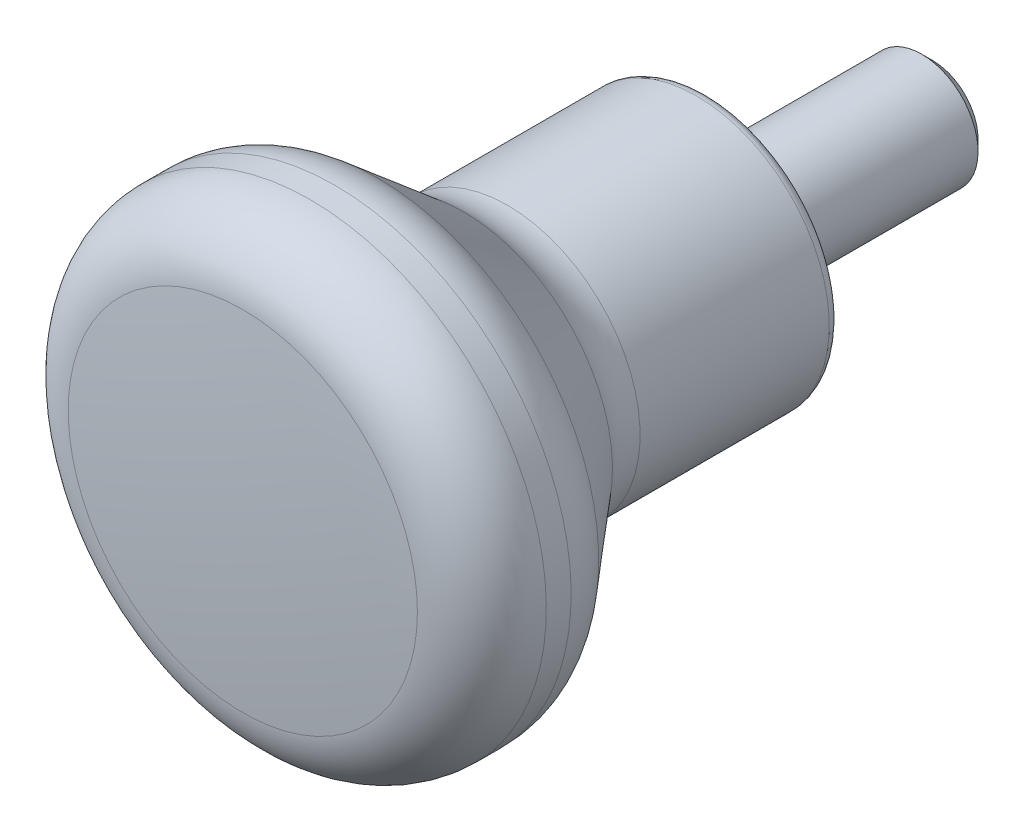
ISO-10303-21;
HEADER;
FILE_DESCRIPTION(('STEP AP214'),'2;1');
FILE_NAME('part.step','',(''),(''),'','','');
FILE_SCHEMA(('AUTOMOTIVE_DESIGN { 1 0 10303 214 1 1 1 1 }'));
ENDSEC;
DATA;
#1=APPLICATION_CONTEXT('core data for automotive mechanical design processes');
#2=APPLICATION_PROTOCOL_DEFINITION('international standard','automotive_design',2000,#1);
#3=PRODUCT_CONTEXT('',#1,'mechanical');
#4=PRODUCT('Part','Part','',(#3));
#5=PRODUCT_RELATED_PRODUCT_CATEGORY('part','',(#4));
#6=PRODUCT_DEFINITION_FORMATION('','',#4);
#7=PRODUCT_DEFINITION_CONTEXT('part definition',#1,'design');
#8=PRODUCT_DEFINITION('design','',#6,#7);
#9=PRODUCT_DEFINITION_SHAPE('','',#8);
#10=(LENGTH_UNIT() NAMED_UNIT(*) SI_UNIT(.MILLI.,.METRE.));
#11=(NAMED_UNIT(*) PLANE_ANGLE_UNIT() SI_UNIT($,.RADIAN.));
#12=(NAMED_UNIT(*) SI_UNIT($,.STERADIAN.) SOLID_ANGLE_UNIT());
#13=UNCERTAINTY_MEASURE_WITH_UNIT(LENGTH_MEASURE(1.E-05),#10,'distance_accuracy_value','');
#14=(GEOMETRIC_REPRESENTATION_CONTEXT(3) GLOBAL_UNCERTAINTY_ASSIGNED_CONTEXT((#13)) GLOBAL_UNIT_ASSIGNED_CONTEXT((#10,
#11,#12)) REPRESENTATION_CONTEXT('',''));
#15=CARTESIAN_POINT('',(0.,0.,0.));
#16=DIRECTION('',(0.,0.,1.));
#17=DIRECTION('',(1.,0.,0.));
#18=AXIS2_PLACEMENT_3D('',#15,#16,#17);
#19=CARTESIAN_POINT('',(-6.90853624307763E-13,0.,-69.0000000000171));
#20=DIRECTION('',(0.,0.,-1.));
#21=DIRECTION('',(1.,0.,0.));
#22=AXIS2_PLACEMENT_3D('',#19,#20,#21);
#23=SPHERICAL_SURFACE('',#22,90.0000000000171);
#24=CARTESIAN_POINT('',(0.,0.,20.664953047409));
#25=DIRECTION('',(0.,0.,-1.));
#26=DIRECTION('',(0.,1.,0.));
#27=AXIS2_PLACEMENT_3D('',#24,#25,#26);
#28=CIRCLE('',#27,7.75862068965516);
#29=CARTESIAN_POINT('',(0.,7.75862068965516,20.664953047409));
#30=VERTEX_POINT('',#29);
#31=EDGE_CURVE('E18',#30,#30,#28,.T.);
#32=ORIENTED_EDGE('',*,*,#31,.F.);
#33=EDGE_LOOP('',(#32));
#34=FACE_BOUND('',#33,.T.);
#35=ADVANCED_FACE('F12',(#34),#23,.T.);
#36=CARTESIAN_POINT('',(0.,0.,17.676121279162));
#37=DIRECTION('',(0.,0.,-1.));
#38=DIRECTION('',(0.,1.,0.));
#39=AXIS2_PLACEMENT_3D('',#36,#37,#38);
#40=TOROIDAL_SURFACE('',#39,7.5,3.);
#41=ORIENTED_EDGE('',*,*,#31,.T.);
#42=EDGE_LOOP('',(#41));
#43=FACE_BOUND('',#42,.T.);
#44=CARTESIAN_POINT('',(0.,0.,17.676121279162));
#45=DIRECTION('',(0.,0.,-1.));
#46=DIRECTION('',(0.,1.,0.));
#47=AXIS2_PLACEMENT_3D('',#44,#45,#46);
#48=CIRCLE('',#47,10.5);
#49=CARTESIAN_POINT('',(0.,10.5,17.676121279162));
#50=VERTEX_POINT('',#49);
#51=EDGE_CURVE('E22',#50,#50,#48,.T.);
#52=ORIENTED_EDGE('',*,*,#51,.F.);
#53=EDGE_LOOP('',(#52));
#54=FACE_BOUND('',#53,.T.);
#55=ADVANCED_FACE('F69',(#43,#54),#40,.T.);
#56=CARTESIAN_POINT('',(0.,0.,0.));
#57=DIRECTION('',(0.,0.,-1.));
#58=DIRECTION('',(0.,1.,0.));
#59=AXIS2_PLACEMENT_3D('',#56,#57,#58);
#60=CYLINDRICAL_SURFACE('',#59,10.5);
#61=CARTESIAN_POINT('',(0.,0.,16.573977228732));
#62=DIRECTION('',(0.,0.,-1.));
#63=DIRECTION('',(0.,1.,0.));
#64=AXIS2_PLACEMENT_3D('',#61,#62,#63);
#65=CIRCLE('',#64,10.5);
#66=CARTESIAN_POINT('',(0.,10.5,16.573977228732));
#67=VERTEX_POINT('',#66);
#68=EDGE_CURVE('E26',#67,#67,#65,.T.);
#69=ORIENTED_EDGE('',*,*,#68,.F.);
#70=EDGE_LOOP('',(#69));
#71=FACE_BOUND('',#70,.T.);
#72=ORIENTED_EDGE('',*,*,#51,.T.);
#73=EDGE_LOOP('',(#72));
#74=FACE_BOUND('',#73,.T.);
#75=ADVANCED_FACE('F74',(#71,#74),#60,.T.);
#76=CARTESIAN_POINT('',(0.,0.,16.573977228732));
#77=DIRECTION('',(0.,0.,-1.));
#78=DIRECTION('',(0.,1.,0.));
#79=AXIS2_PLACEMENT_3D('',#76,#77,#78);
#80=TOROIDAL_SURFACE('',#79,7.5,3.);
#81=ORIENTED_EDGE('',*,*,#68,.T.);
#82=EDGE_LOOP('',(#81));
#83=FACE_BOUND('',#82,.T.);
#84=CARTESIAN_POINT('',(0.,0.,14.6456143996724));
#85=DIRECTION('',(0.,0.,-1.));
#86=DIRECTION('',(0.,1.,0.));
#87=AXIS2_PLACEMENT_3D('',#84,#85,#86);
#88=CIRCLE('',#87,9.79813332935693);
#89=CARTESIAN_POINT('',(0.,9.79813332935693,14.6456143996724));
#90=VERTEX_POINT('',#89);
#91=EDGE_CURVE('E31',#90,#90,#88,.T.);
#92=ORIENTED_EDGE('',*,*,#91,.F.);
#93=EDGE_LOOP('',(#92));
#94=FACE_BOUND('',#93,.T.);
#95=ADVANCED_FACE('F78',(#83,#94),#80,.T.);
#96=CARTESIAN_POINT('',(0.,0.,14.6456143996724));
#97=DIRECTION('',(0.,0.,1.));
#98=DIRECTION('',(0.,-1.,0.));
#99=AXIS2_PLACEMENT_3D('',#96,#97,#98);
#100=CONICAL_SURFACE('',#99,9.79813332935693,0.698131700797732);
#101=CARTESIAN_POINT('',(0.,0.,10.836452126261));
#102=DIRECTION('',(0.,0.,-1.));
#103=DIRECTION('',(0.,1.,0.));
#104=AXIS2_PLACEMENT_3D('',#101,#102,#103);
#105=CIRCLE('',#104,6.60186667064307);
#106=CARTESIAN_POINT('',(0.,6.60186667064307,10.836452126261));
#107=VERTEX_POINT('',#106);
#108=EDGE_CURVE('E34',#107,#107,#105,.T.);
#109=ORIENTED_EDGE('',*,*,#108,.F.);
#110=EDGE_LOOP('',(#109));
#111=FACE_BOUND('',#110,.T.);
#112=ORIENTED_EDGE('',*,*,#91,.T.);
#113=EDGE_LOOP('',(#112));
#114=FACE_BOUND('',#113,.T.);
#115=ADVANCED_FACE('F85',(#111,#114),#100,.T.);
#116=CARTESIAN_POINT('',(0.,0.,8.90808929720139));
#117=DIRECTION('',(0.,0.,-1.));
#118=DIRECTION('',(0.,1.,0.));
#119=AXIS2_PLACEMENT_3D('',#116,#117,#118);
#120=TOROIDAL_SURFACE('',#119,8.9,3.);
#121=CARTESIAN_POINT('',(0.,0.,8.90808929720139));
#122=DIRECTION('',(0.,0.,-1.));
#123=DIRECTION('',(0.,1.,0.));
#124=AXIS2_PLACEMENT_3D('',#121,#122,#123);
#125=CIRCLE('',#124,5.9);
#126=CARTESIAN_POINT('',(0.,5.9,8.90808929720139));
#127=VERTEX_POINT('',#126);
#128=EDGE_CURVE('E37',#127,#127,#125,.T.);
#129=ORIENTED_EDGE('',*,*,#128,.F.);
#130=EDGE_LOOP('',(#129));
#131=FACE_BOUND('',#130,.T.);
#132=ORIENTED_EDGE('',*,*,#108,.T.);
#133=EDGE_LOOP('',(#132));
#134=FACE_BOUND('',#133,.T.);
#135=ADVANCED_FACE('F89',(#131,#134),#120,.F.);
#136=CARTESIAN_POINT('',(0.,0.,0.));
#137=DIRECTION('',(0.,0.,-1.));
#138=DIRECTION('',(0.,1.,0.));
#139=AXIS2_PLACEMENT_3D('',#136,#137,#138);
#140=CYLINDRICAL_SURFACE('',#139,5.9);
#141=CARTESIAN_POINT('',(0.,0.,0.5));
#142=DIRECTION('',(0.,0.,-1.));
#143=DIRECTION('',(0.,1.,0.));
#144=AXIS2_PLACEMENT_3D('',#141,#142,#143);
#145=CIRCLE('',#144,5.9);
#146=CARTESIAN_POINT('',(0.,5.9,0.5));
#147=VERTEX_POINT('',#146);
#148=EDGE_CURVE('E40',#147,#147,#145,.T.);
#149=ORIENTED_EDGE('',*,*,#148,.F.);
#150=EDGE_LOOP('',(#149));
#151=FACE_BOUND('',#150,.T.);
#152=ORIENTED_EDGE('',*,*,#128,.T.);
#153=EDGE_LOOP('',(#152));
#154=FACE_BOUND('',#153,.T.);
#155=ADVANCED_FACE('F93',(#151,#154),#140,.T.);
#156=CARTESIAN_POINT('',(0.,0.,0.5));
#157=DIRECTION('',(0.,0.,-1.));
#158=DIRECTION('',(0.,1.,0.));
#159=AXIS2_PLACEMENT_3D('',#156,#157,#158);
#160=TOROIDAL_SURFACE('',#159,5.4,0.5);
#161=ORIENTED_EDGE('',*,*,#148,.T.);
#162=EDGE_LOOP('',(#161));
#163=FACE_BOUND('',#162,.T.);
#164=CARTESIAN_POINT('',(0.,0.,0.));
#165=DIRECTION('',(0.,0.,-1.));
#166=DIRECTION('',(0.,1.,0.));
#167=AXIS2_PLACEMENT_3D('',#164,#165,#166);
#168=CIRCLE('',#167,5.4);
#169=CARTESIAN_POINT('',(0.,5.4,0.));
#170=VERTEX_POINT('',#169);
#171=EDGE_CURVE('E43',#170,#170,#168,.T.);
#172=ORIENTED_EDGE('',*,*,#171,.F.);
#173=EDGE_LOOP('',(#172));
#174=FACE_BOUND('',#173,.T.);
#175=ADVANCED_FACE('F97',(#163,#174),#160,.T.);
#176=CARTESIAN_POINT('',(5.4,0.,0.));
#177=DIRECTION('',(0.,0.,1.));
#178=DIRECTION('',(0.,-1.,0.));
#179=AXIS2_PLACEMENT_3D('',#176,#177,#178);
#180=PLANE('',#179);
#181=CARTESIAN_POINT('',(0.,0.,0.));
#182=DIRECTION('',(0.,0.,1.));
#183=DIRECTION('',(0.,-1.,0.));
#184=AXIS2_PLACEMENT_3D('',#181,#182,#183);
#185=CIRCLE('',#184,2.5);
#186=CARTESIAN_POINT('',(0.,-2.5,0.));
#187=VERTEX_POINT('',#186);
#188=EDGE_CURVE('E8',#187,#187,#185,.F.);
#189=ORIENTED_EDGE('',*,*,#188,.F.);
#190=EDGE_LOOP('',(#189));
#191=FACE_BOUND('',#190,.T.);
#192=ORIENTED_EDGE('',*,*,#171,.T.);
#193=EDGE_LOOP('',(#192));
#194=FACE_BOUND('',#193,.T.);
#195=ADVANCED_FACE('F100',(#191,#194),#180,.F.);
#196=CARTESIAN_POINT('',(2.0095,0.,-10.));
#197=DIRECTION('',(0.,0.,1.));
#198=DIRECTION('',(0.,-1.,0.));
#199=AXIS2_PLACEMENT_3D('',#196,#197,#198);
#200=PLANE('',#199);
#201=CARTESIAN_POINT('',(0.,0.,-10.));
#202=DIRECTION('',(0.,0.,-1.));
#203=DIRECTION('',(0.,1.,0.));
#204=AXIS2_PLACEMENT_3D('',#201,#202,#203);
#205=CIRCLE('',#204,2.0095);
#206=CARTESIAN_POINT('',(0.,2.0095,-10.));
#207=VERTEX_POINT('',#206);
#208=EDGE_CURVE('E49',#207,#207,#205,.T.);
#209=ORIENTED_EDGE('',*,*,#208,.T.);
#210=EDGE_LOOP('',(#209));
#211=FACE_BOUND('',#210,.T.);
#212=ADVANCED_FACE('F53',(#211),#200,.F.);
#213=CARTESIAN_POINT('',(0.,0.,-9.5095));
#214=DIRECTION('',(0.,0.,1.));
#215=DIRECTION('',(0.,-1.,0.));
#216=AXIS2_PLACEMENT_3D('',#213,#214,#215);
#217=CONICAL_SURFACE('',#216,2.5,0.785398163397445);
#218=ORIENTED_EDGE('',*,*,#208,.F.);
#219=EDGE_LOOP('',(#218));
#220=FACE_BOUND('',#219,.T.);
#221=CARTESIAN_POINT('',(0.,0.,-9.5095));
#222=DIRECTION('',(0.,0.,-1.));
#223=DIRECTION('',(0.,1.,0.));
#224=AXIS2_PLACEMENT_3D('',#221,#222,#223);
#225=CIRCLE('',#224,2.5);
#226=CARTESIAN_POINT('',(0.,2.5,-9.5095));
#227=VERTEX_POINT('',#226);
#228=EDGE_CURVE('E46',#227,#227,#225,.T.);
#229=ORIENTED_EDGE('',*,*,#228,.T.);
#230=EDGE_LOOP('',(#229));
#231=FACE_BOUND('',#230,.T.);
#232=ADVANCED_FACE('F55',(#220,#231),#217,.T.);
#233=CARTESIAN_POINT('',(0.,0.,-10.));
#234=DIRECTION('',(0.,0.,-1.));
#235=DIRECTION('',(0.,1.,0.));
#236=AXIS2_PLACEMENT_3D('',#233,#234,#235);
#237=CYLINDRICAL_SURFACE('',#236,2.5);
#238=ORIENTED_EDGE('',*,*,#228,.F.);
#239=EDGE_LOOP('',(#238));
#240=FACE_BOUND('',#239,.T.);
#241=ORIENTED_EDGE('',*,*,#188,.T.);
#242=EDGE_LOOP('',(#241));
#243=FACE_BOUND('',#242,.T.);
#244=ADVANCED_FACE('F58',(#240,#243),#237,.T.);
#245=CLOSED_SHELL('',(#35,#55,#75,#95,#115,#135,#155,#175,#195,#212,#232,#244));
#246=MANIFOLD_SOLID_BREP('B1',#245);
#247=ADVANCED_BREP_SHAPE_REPRESENTATION('',(#18,#246),#14);
#248=SHAPE_DEFINITION_REPRESENTATION(#9,#247);
ENDSEC;
END-ISO-10303-21;
